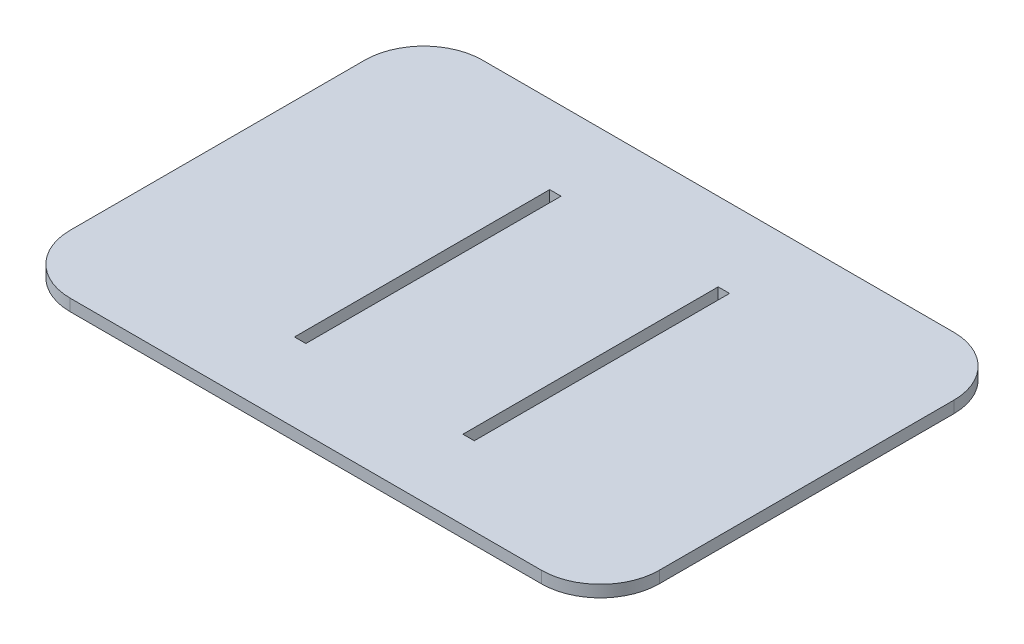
from build123d import *

# Parameters (mm, degrees)
ESQUISSE1_W        = 2.9
ESQUISSE1_H        = 65
BOSS_EXTRU_1_DEPTH = 3


with BuildPart() as part:
    # Esquisse1 → Boss.-Extru.1 (new body)
    with BuildSketch(Plane(origin=(0, 0, 0), x_dir=(1, 0, 0), z_dir=(0, 1, 0))):
        with BuildLine():
            Line((-60, -65), (60, -65))
            ThreePointArc((60, -65), (70.606601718, -60.606601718), (75, -50))
            Line((75, -50), (75, 25))
            ThreePointArc((75, 25), (70.606601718, 35.606601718), (60, 40))
            Line((60, 40), (-60, 40))
            ThreePointArc((-60, 40), (-70.606601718, 35.606601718), (-75, 25))
            Line((-75, 25), (-75, -50))
            ThreePointArc((-75, -50), (-70.606601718, -60.606601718), (-60, -65))
        make_face()
        with Locations((-21.45, -12.5)):
            Rectangle(ESQUISSE1_W, ESQUISSE1_H, mode=Mode.SUBTRACT)
        with Locations((21.45, -12.5)):
            Rectangle(ESQUISSE1_W, ESQUISSE1_H, mode=Mode.SUBTRACT)
    extrude(amount=BOSS_EXTRU_1_DEPTH)


solid = part.part
